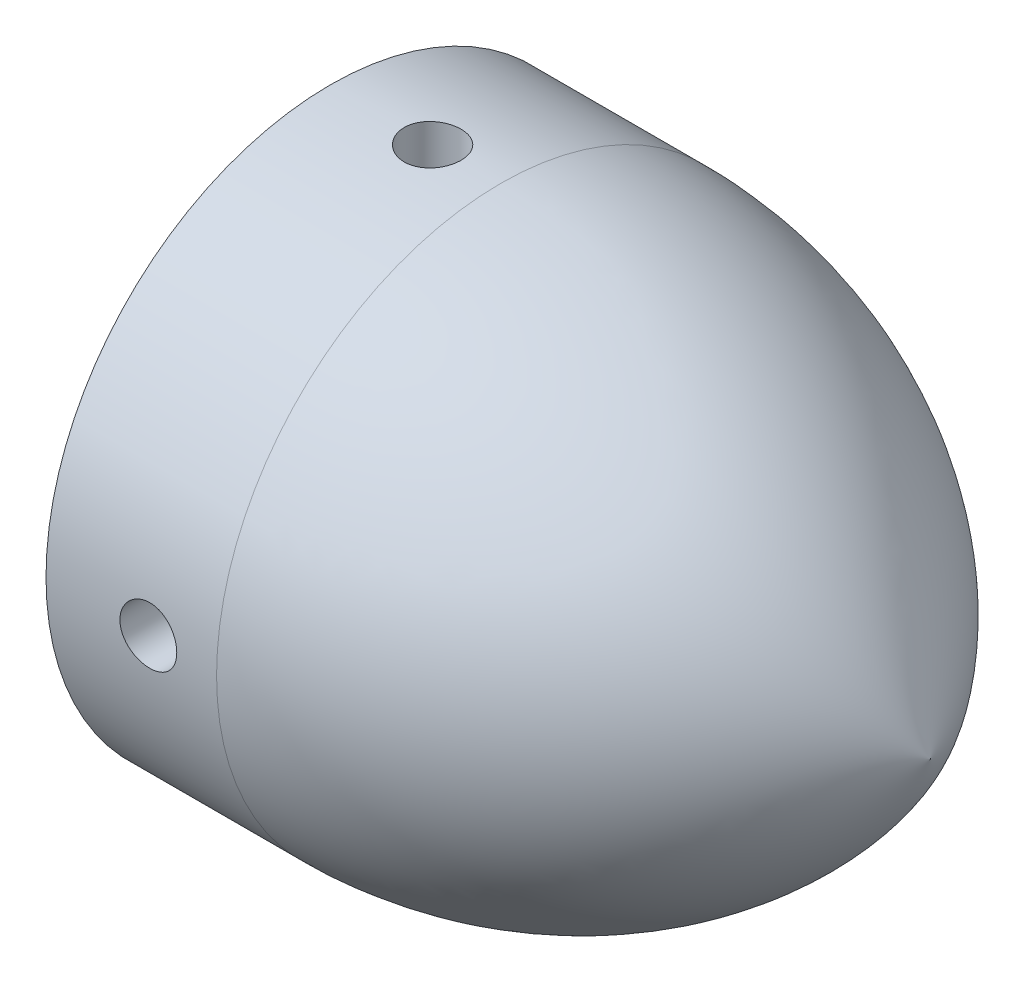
ISO-10303-21;
HEADER;
FILE_DESCRIPTION(('STEP AP214'),'2;1');
FILE_NAME('part.step','',(''),(''),'','','');
FILE_SCHEMA(('AUTOMOTIVE_DESIGN { 1 0 10303 214 1 1 1 1 }'));
ENDSEC;
DATA;
#1=APPLICATION_CONTEXT('core data for automotive mechanical design processes');
#2=APPLICATION_PROTOCOL_DEFINITION('international standard','automotive_design',2000,#1);
#3=PRODUCT_CONTEXT('',#1,'mechanical');
#4=PRODUCT('Part','Part','',(#3));
#5=PRODUCT_RELATED_PRODUCT_CATEGORY('part','',(#4));
#6=PRODUCT_DEFINITION_FORMATION('','',#4);
#7=PRODUCT_DEFINITION_CONTEXT('part definition',#1,'design');
#8=PRODUCT_DEFINITION('design','',#6,#7);
#9=PRODUCT_DEFINITION_SHAPE('','',#8);
#10=(LENGTH_UNIT() NAMED_UNIT(*) SI_UNIT(.MILLI.,.METRE.));
#11=(NAMED_UNIT(*) PLANE_ANGLE_UNIT() SI_UNIT($,.RADIAN.));
#12=(NAMED_UNIT(*) SI_UNIT($,.STERADIAN.) SOLID_ANGLE_UNIT());
#13=UNCERTAINTY_MEASURE_WITH_UNIT(LENGTH_MEASURE(1.E-05),#10,'distance_accuracy_value','');
#14=(GEOMETRIC_REPRESENTATION_CONTEXT(3) GLOBAL_UNCERTAINTY_ASSIGNED_CONTEXT((#13)) GLOBAL_UNIT_ASSIGNED_CONTEXT((#10,
#11,#12)) REPRESENTATION_CONTEXT('',''));
#15=CARTESIAN_POINT('',(0.,0.,0.));
#16=DIRECTION('',(0.,0.,1.));
#17=DIRECTION('',(1.,0.,0.));
#18=AXIS2_PLACEMENT_3D('',#15,#16,#17);
#19=CARTESIAN_POINT('',(0.,0.,0.));
#20=DIRECTION('',(1.,0.,0.));
#21=DIRECTION('',(0.,0.,-1.));
#22=AXIS2_PLACEMENT_3D('',#19,#20,#21);
#23=PLANE('',#22);
#24=CARTESIAN_POINT('',(0.,0.,0.));
#25=DIRECTION('',(-1.,0.,0.));
#26=DIRECTION('',(0.,0.,1.));
#27=AXIS2_PLACEMENT_3D('',#24,#25,#26);
#28=CIRCLE('',#27,40.);
#29=CARTESIAN_POINT('',(0.,0.,40.));
#30=VERTEX_POINT('',#29);
#31=EDGE_CURVE('E60',#30,#30,#28,.T.);
#32=ORIENTED_EDGE('',*,*,#31,.F.);
#33=EDGE_LOOP('',(#32));
#34=FACE_BOUND('',#33,.T.);
#35=CARTESIAN_POINT('',(0.,0.,0.));
#36=DIRECTION('',(-1.,0.,0.));
#37=DIRECTION('',(0.,0.,1.));
#38=AXIS2_PLACEMENT_3D('',#35,#36,#37);
#39=CIRCLE('',#38,50.);
#40=CARTESIAN_POINT('',(0.,0.,50.));
#41=VERTEX_POINT('',#40);
#42=EDGE_CURVE('E76',#41,#41,#39,.T.);
#43=ORIENTED_EDGE('',*,*,#42,.T.);
#44=EDGE_LOOP('',(#43));
#45=FACE_BOUND('',#44,.T.);
#46=ADVANCED_FACE('F34',(#34,#45),#23,.F.);
#47=CARTESIAN_POINT('',(0.,0.,0.));
#48=DIRECTION('',(-1.,0.,0.));
#49=DIRECTION('',(0.,0.,1.));
#50=AXIS2_PLACEMENT_3D('',#47,#48,#49);
#51=CYLINDRICAL_SURFACE('',#50,50.);
#52=CARTESIAN_POINT('',(18.,-49.7493718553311,-4.99999999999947));
#53=CARTESIAN_POINT('',(17.8599015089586,-49.749371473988,-5.00000137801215));
#54=CARTESIAN_POINT('',(17.7198240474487,-49.7499648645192,-4.99410950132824));
#55=CARTESIAN_POINT('',(17.4406233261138,-49.752320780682,-4.97058574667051));
#56=CARTESIAN_POINT('',(17.3015003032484,-49.7540835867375,-4.9529510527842));
#57=CARTESIAN_POINT('',(17.0251372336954,-49.758730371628,-4.90604778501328));
#58=CARTESIAN_POINT('',(16.8878987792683,-49.761615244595,-4.87676993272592));
#59=CARTESIAN_POINT('',(16.616340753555,-49.7684245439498,-4.80678208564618));
#60=CARTESIAN_POINT('',(16.4820222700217,-49.7723493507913,-4.76606790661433));
#61=CARTESIAN_POINT('',(16.2174387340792,-49.7811214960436,-4.6735529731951));
#62=CARTESIAN_POINT('',(16.0871698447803,-49.7859679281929,-4.62176310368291));
#63=CARTESIAN_POINT('',(15.8314177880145,-49.7964498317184,-4.507424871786));
#64=CARTESIAN_POINT('',(15.7059364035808,-49.8020855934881,-4.44487254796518));
#65=CARTESIAN_POINT('',(15.4607606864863,-49.8139814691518,-4.30950824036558));
#66=CARTESIAN_POINT('',(15.3410630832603,-49.820241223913,-4.2367021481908));
#67=CARTESIAN_POINT('',(15.1081706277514,-49.833213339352,-4.08129001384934));
#68=CARTESIAN_POINT('',(14.9949782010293,-49.8399258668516,-3.99868035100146));
#69=CARTESIAN_POINT('',(14.7756190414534,-49.8536318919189,-3.82401365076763));
#70=CARTESIAN_POINT('',(14.6694733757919,-49.8606261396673,-3.73193021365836));
#71=CARTESIAN_POINT('',(14.4652704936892,-49.8746822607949,-3.53912598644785));
#72=CARTESIAN_POINT('',(14.3672162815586,-49.8817441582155,-3.43840201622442));
#73=CARTESIAN_POINT('',(14.1799593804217,-49.8957312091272,-3.22908697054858));
#74=CARTESIAN_POINT('',(14.0907538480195,-49.9026564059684,-3.12049844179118));
#75=CARTESIAN_POINT('',(13.9217563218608,-49.9161794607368,-2.89614565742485));
#76=CARTESIAN_POINT('',(13.8419678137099,-49.9227771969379,-2.78037876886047));
#77=CARTESIAN_POINT('',(13.6922791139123,-49.9354672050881,-2.54231086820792));
#78=CARTESIAN_POINT('',(13.6223963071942,-49.9415585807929,-2.41999887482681));
#79=CARTESIAN_POINT('',(13.4931611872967,-49.95305247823,-2.16984658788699));
#80=CARTESIAN_POINT('',(13.4338127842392,-49.9584547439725,-2.04200426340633));
#81=CARTESIAN_POINT('',(13.3261283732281,-49.9684119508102,-1.78177823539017));
#82=CARTESIAN_POINT('',(13.2777880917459,-49.9729672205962,-1.64939631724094));
#83=CARTESIAN_POINT('',(13.1924285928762,-49.9811060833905,-1.38098814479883));
#84=CARTESIAN_POINT('',(13.1554135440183,-49.9846893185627,-1.24496056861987));
#85=CARTESIAN_POINT('',(13.0620633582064,-49.9937912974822,-0.833882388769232));
#86=CARTESIAN_POINT('',(13.0229400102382,-49.9977085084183,-0.554665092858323));
#87=CARTESIAN_POINT('',(12.992109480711,-50.0007876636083,0.00624616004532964));
#88=CARTESIAN_POINT('',(13.0004010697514,-49.9999497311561,0.287940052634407));
#89=CARTESIAN_POINT('',(13.0639761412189,-49.9936330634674,0.844932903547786));
#90=CARTESIAN_POINT('',(13.1190915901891,-49.9881709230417,1.12025111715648));
#91=CARTESIAN_POINT('',(13.2745046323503,-49.9732365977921,1.65769893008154));
#92=CARTESIAN_POINT('',(13.3748028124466,-49.9637643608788,1.91982835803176));
#93=CARTESIAN_POINT('',(13.6179140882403,-49.9418468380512,2.42400075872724));
#94=CARTESIAN_POINT('',(13.7608015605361,-49.9293963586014,2.66600763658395));
#95=CARTESIAN_POINT('',(14.0849825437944,-49.9029192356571,3.12266778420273));
#96=CARTESIAN_POINT('',(14.266277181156,-49.8888925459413,3.3373202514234));
#97=CARTESIAN_POINT('',(14.6630711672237,-49.8607646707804,3.73416380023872));
#98=CARTESIAN_POINT('',(14.8787167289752,-49.8466634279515,3.91620871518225));
#99=CARTESIAN_POINT('',(15.3375843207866,-49.8200369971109,4.24153769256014));
#100=CARTESIAN_POINT('',(15.5808063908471,-49.8075118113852,4.38482169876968));
#101=CARTESIAN_POINT('',(16.0880351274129,-49.7854544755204,4.62856091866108));
#102=CARTESIAN_POINT('',(16.3520461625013,-49.7759229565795,4.72900710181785));
#103=CARTESIAN_POINT('',(16.8933030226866,-49.760945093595,4.88410367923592));
#104=CARTESIAN_POINT('',(17.1705484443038,-49.755498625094,4.93875546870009));
#105=CARTESIAN_POINT('',(17.7291208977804,-49.7493290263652,5.00052387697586));
#106=CARTESIAN_POINT('',(18.0104251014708,-49.7485855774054,5.00784498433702));
#107=CARTESIAN_POINT('',(18.5702563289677,-49.7518525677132,4.97528123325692));
#108=CARTESIAN_POINT('',(18.8487833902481,-49.7558629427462,4.9353970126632));
#109=CARTESIAN_POINT('',(19.3945579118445,-49.7681672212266,4.809725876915));
#110=CARTESIAN_POINT('',(19.6618278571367,-49.7764521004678,4.72403565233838));
#111=CARTESIAN_POINT('',(20.1782002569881,-49.7963645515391,4.50928358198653));
#112=CARTESIAN_POINT('',(20.427302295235,-49.8079921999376,4.38022074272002));
#113=CARTESIAN_POINT('',(20.9011998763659,-49.8333292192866,4.08187506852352));
#114=CARTESIAN_POINT('',(21.125909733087,-49.8470455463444,3.91245672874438));
#115=CARTESIAN_POINT('',(21.543775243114,-49.8749916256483,3.53840243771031));
#116=CARTESIAN_POINT('',(21.7369301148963,-49.8892213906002,3.33376561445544));
#117=CARTESIAN_POINT('',(22.0869082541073,-49.9166524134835,2.89419988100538));
#118=CARTESIAN_POINT('',(22.243598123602,-49.9298497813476,2.65916449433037));
#119=CARTESIAN_POINT('',(22.5152790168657,-49.9536720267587,2.16598537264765));
#120=CARTESIAN_POINT('',(22.6302706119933,-49.9642969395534,1.90784195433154));
#121=CARTESIAN_POINT('',(22.8150700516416,-49.9817608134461,1.376292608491));
#122=CARTESIAN_POINT('',(22.8849584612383,-49.9886065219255,1.10291484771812));
#123=CARTESIAN_POINT('',(22.9778108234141,-49.99776363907,0.548079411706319));
#124=CARTESIAN_POINT('',(23.0007760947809,-50.0000751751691,0.266621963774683));
#125=CARTESIAN_POINT('',(22.9995818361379,-49.9999593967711,-0.154560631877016));
#126=CARTESIAN_POINT('',(22.9932830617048,-49.9993276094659,-0.294557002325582));
#127=CARTESIAN_POINT('',(22.9689691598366,-49.9969046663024,-0.573504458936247));
#128=CARTESIAN_POINT('',(22.9509583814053,-49.9951139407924,-0.712455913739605));
#129=CARTESIAN_POINT('',(22.903338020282,-49.9904208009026,-0.988379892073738));
#130=CARTESIAN_POINT('',(22.8737241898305,-49.9875179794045,-1.12535167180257));
#131=CARTESIAN_POINT('',(22.8031292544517,-49.9806844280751,-1.39625643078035));
#132=CARTESIAN_POINT('',(22.7621523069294,-49.9767540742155,-1.53019050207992));
#133=CARTESIAN_POINT('',(22.6691118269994,-49.967974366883,-1.79415256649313));
#134=CARTESIAN_POINT('',(22.6170458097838,-49.963124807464,-1.92417967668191));
#135=CARTESIAN_POINT('',(22.5022278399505,-49.952645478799,-2.17933687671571));
#136=CARTESIAN_POINT('',(22.4394797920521,-49.9470159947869,-2.30446873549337));
#137=CARTESIAN_POINT('',(22.303707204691,-49.9351311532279,-2.54905381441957));
#138=CARTESIAN_POINT('',(22.2306790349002,-49.9288755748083,-2.66850500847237));
#139=CARTESIAN_POINT('',(22.0749077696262,-49.9159178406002,-2.90080624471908));
#140=CARTESIAN_POINT('',(21.9921682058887,-49.9092158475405,-3.01365866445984));
#141=CARTESIAN_POINT('',(21.817134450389,-49.89551955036,-3.23252356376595));
#142=CARTESIAN_POINT('',(21.7247983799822,-49.8885240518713,-3.33850247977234));
#143=CARTESIAN_POINT('',(21.5315725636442,-49.8744696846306,-3.54227369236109));
#144=CARTESIAN_POINT('',(21.4306859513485,-49.8674108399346,-3.64006896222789));
#145=CARTESIAN_POINT('',(21.2209737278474,-49.8534223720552,-3.82688647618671));
#146=CARTESIAN_POINT('',(21.1121433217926,-49.8464928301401,-3.91590334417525));
#147=CARTESIAN_POINT('',(20.8874031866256,-49.8329662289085,-4.08443675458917));
#148=CARTESIAN_POINT('',(20.7714960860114,-49.8263690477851,-4.16395679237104));
#149=CARTESIAN_POINT('',(20.5330311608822,-49.8136731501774,-4.31318841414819));
#150=CARTESIAN_POINT('',(20.410454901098,-49.807575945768,-4.38287067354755));
#151=CARTESIAN_POINT('',(20.1598775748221,-49.7960782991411,-4.5116254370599));
#152=CARTESIAN_POINT('',(20.031878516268,-49.7906776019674,-4.57070182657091));
#153=CARTESIAN_POINT('',(19.7714258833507,-49.7807295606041,-4.67780484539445));
#154=CARTESIAN_POINT('',(19.6389760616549,-49.7761815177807,-4.72584052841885));
#155=CARTESIAN_POINT('',(19.3705126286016,-49.7680650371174,-4.81056224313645));
#156=CARTESIAN_POINT('',(19.2344999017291,-49.76449635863,-4.84725106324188));
#157=CARTESIAN_POINT('',(18.9173342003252,-49.7575042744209,-4.91858203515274));
#158=CARTESIAN_POINT('',(18.7352262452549,-49.7544669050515,-4.94908441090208));
#159=CARTESIAN_POINT('',(18.3687333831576,-49.7504009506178,-4.98979244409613));
#160=CARTESIAN_POINT('',(18.1843484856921,-49.749372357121,-4.99999818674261));
#161=CARTESIAN_POINT('',(18.,-49.7493718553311,-4.99999999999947));
#162=B_SPLINE_CURVE_WITH_KNOTS('',3,(#52,#53,#54,#55,#56,#57,#58,#59,#60,#61,#62,#63,#64,#65,
#66,#67,#68,#69,#70,#71,#72,#73,#74,#75,#76,#77,#78,#79,#80,#81,#82,#83,#84,#85,#86,#87,#88,#89,
#90,#91,#92,#93,#94,#95,#96,#97,#98,#99,#100,#101,#102,#103,#104,#105,#106,#107,#108,#109,#110,
#111,#112,#113,#114,#115,#116,#117,#118,#119,#120,#121,#122,#123,#124,#125,#126,#127,#128,#129,
#130,#131,#132,#133,#134,#135,#136,#137,#138,#139,#140,#141,#142,#143,#144,#145,#146,#147,#148,
#149,#150,#151,#152,#153,#154,#155,#156,#157,#158,#159,#160,#161),.UNSPECIFIED.,.T.,.F.,(4,2,2,
2,2,2,2,2,2,2,2,2,2,2,2,2,2,2,2,2,2,2,2,2,2,2,2,2,2,2,2,2,2,2,2,2,2,2,2,2,2,2,2,2,2,2,2,2,2,2,2,
2,2,2,4),(0.,0.420134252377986,0.840369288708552,1.26093988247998,1.68166455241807,
2.10197763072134,2.52244574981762,2.94267325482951,3.36305644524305,3.78464455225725,
4.20638849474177,4.62799647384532,5.04976002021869,5.47225484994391,5.8949061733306,
6.31739313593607,6.74003541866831,7.58156484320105,8.42307244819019,9.26157288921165,
10.1000842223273,10.9400685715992,11.780077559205,12.6237625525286,13.4674487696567,
14.3113127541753,15.1551510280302,15.9953411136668,16.8355198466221,17.6739320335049,
18.5123634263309,19.3536507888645,20.1949589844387,21.0392981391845,21.8836257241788,
22.7264409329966,23.569232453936,23.9892420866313,24.4090958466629,24.8291034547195,
25.2489575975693,25.6689059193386,26.0887010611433,26.5086448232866,26.9284363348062,
27.3501435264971,27.7716968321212,28.1935067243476,28.6151608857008,29.0380465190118,
29.4607769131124,29.8831594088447,30.3054380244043,30.8582736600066,31.411106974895),.UNSPECIFIED.);
#163=CARTESIAN_POINT('',(18.,-49.7493718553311,-4.99999999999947));
#164=VERTEX_POINT('',#163);
#165=EDGE_CURVE('E11',#164,#164,#162,.T.);
#166=ORIENTED_EDGE('',*,*,#165,.T.);
#167=EDGE_LOOP('',(#166));
#168=FACE_BOUND('',#167,.T.);
#169=CARTESIAN_POINT('',(18.,4.99999999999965,-49.749371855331));
#170=CARTESIAN_POINT('',(17.8599015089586,5.00000137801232,-49.7493714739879));
#171=CARTESIAN_POINT('',(17.7198240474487,4.99410950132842,-49.7499648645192));
#172=CARTESIAN_POINT('',(17.4406233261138,4.97058574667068,-49.752320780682));
#173=CARTESIAN_POINT('',(17.3015003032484,4.95295105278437,-49.7540835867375));
#174=CARTESIAN_POINT('',(17.0251372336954,4.90604778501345,-49.758730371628));
#175=CARTESIAN_POINT('',(16.8878987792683,4.87676993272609,-49.761615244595));
#176=CARTESIAN_POINT('',(16.616340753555,4.80678208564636,-49.7684245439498));
#177=CARTESIAN_POINT('',(16.4820222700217,4.7660679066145,-49.7723493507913));
#178=CARTESIAN_POINT('',(16.2174387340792,4.67355297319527,-49.7811214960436));
#179=CARTESIAN_POINT('',(16.0871698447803,4.62176310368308,-49.7859679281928));
#180=CARTESIAN_POINT('',(15.8314177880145,4.50742487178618,-49.7964498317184));
#181=CARTESIAN_POINT('',(15.7059364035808,4.44487254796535,-49.8020855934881));
#182=CARTESIAN_POINT('',(15.4607606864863,4.30950824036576,-49.8139814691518));
#183=CARTESIAN_POINT('',(15.3410630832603,4.23670214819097,-49.820241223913));
#184=CARTESIAN_POINT('',(15.1081706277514,4.08129001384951,-49.833213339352));
#185=CARTESIAN_POINT('',(14.9949782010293,3.99868035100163,-49.8399258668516));
#186=CARTESIAN_POINT('',(14.7756190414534,3.8240136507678,-49.8536318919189));
#187=CARTESIAN_POINT('',(14.6694733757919,3.73193021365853,-49.8606261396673));
#188=CARTESIAN_POINT('',(14.4652704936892,3.53912598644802,-49.8746822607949));
#189=CARTESIAN_POINT('',(14.3672162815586,3.43840201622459,-49.8817441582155));
#190=CARTESIAN_POINT('',(14.1799593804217,3.22908697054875,-49.8957312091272));
#191=CARTESIAN_POINT('',(14.0907538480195,3.12049844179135,-49.9026564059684));
#192=CARTESIAN_POINT('',(13.9217563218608,2.89614565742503,-49.9161794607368));
#193=CARTESIAN_POINT('',(13.8419678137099,2.78037876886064,-49.9227771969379));
#194=CARTESIAN_POINT('',(13.6922791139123,2.5423108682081,-49.9354672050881));
#195=CARTESIAN_POINT('',(13.6223963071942,2.41999887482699,-49.9415585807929));
#196=CARTESIAN_POINT('',(13.4931611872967,2.16984658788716,-49.95305247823));
#197=CARTESIAN_POINT('',(13.4338127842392,2.0420042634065,-49.9584547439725));
#198=CARTESIAN_POINT('',(13.3261283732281,1.78177823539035,-49.9684119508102));
#199=CARTESIAN_POINT('',(13.2777880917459,1.64939631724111,-49.9729672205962));
#200=CARTESIAN_POINT('',(13.1924285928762,1.380988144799,-49.9811060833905));
#201=CARTESIAN_POINT('',(13.1554135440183,1.24496056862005,-49.9846893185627));
#202=CARTESIAN_POINT('',(13.0620633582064,0.833882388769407,-49.9937912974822));
#203=CARTESIAN_POINT('',(13.0229400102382,0.554665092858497,-49.9977085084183));
#204=CARTESIAN_POINT('',(12.992109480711,-0.0062461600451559,-50.0007876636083));
#205=CARTESIAN_POINT('',(13.0004010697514,-0.287940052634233,-49.9999497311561));
#206=CARTESIAN_POINT('',(13.0639761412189,-0.844932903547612,-49.9936330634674));
#207=CARTESIAN_POINT('',(13.1190915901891,-1.1202511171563,-49.9881709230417));
#208=CARTESIAN_POINT('',(13.2745046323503,-1.65769893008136,-49.9732365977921));
#209=CARTESIAN_POINT('',(13.3748028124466,-1.91982835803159,-49.9637643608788));
#210=CARTESIAN_POINT('',(13.6179140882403,-2.42400075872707,-49.9418468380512));
#211=CARTESIAN_POINT('',(13.7608015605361,-2.66600763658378,-49.9293963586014));
#212=CARTESIAN_POINT('',(14.0849825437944,-3.12266778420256,-49.9029192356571));
#213=CARTESIAN_POINT('',(14.266277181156,-3.33732025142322,-49.8888925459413));
#214=CARTESIAN_POINT('',(14.6630711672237,-3.73416380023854,-49.8607646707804));
#215=CARTESIAN_POINT('',(14.8787167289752,-3.91620871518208,-49.8466634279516));
#216=CARTESIAN_POINT('',(15.3375843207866,-4.24153769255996,-49.8200369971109));
#217=CARTESIAN_POINT('',(15.5808063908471,-4.38482169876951,-49.8075118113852));
#218=CARTESIAN_POINT('',(16.0880351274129,-4.62856091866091,-49.7854544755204));
#219=CARTESIAN_POINT('',(16.3520461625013,-4.72900710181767,-49.7759229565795));
#220=CARTESIAN_POINT('',(16.8933030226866,-4.88410367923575,-49.760945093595));
#221=CARTESIAN_POINT('',(17.1705484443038,-4.93875546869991,-49.755498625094));
#222=CARTESIAN_POINT('',(17.7291208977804,-5.00052387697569,-49.7493290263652));
#223=CARTESIAN_POINT('',(18.0104251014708,-5.00784498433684,-49.7485855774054));
#224=CARTESIAN_POINT('',(18.5702563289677,-4.97528123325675,-49.7518525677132));
#225=CARTESIAN_POINT('',(18.8487833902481,-4.93539701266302,-49.7558629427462));
#226=CARTESIAN_POINT('',(19.3945579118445,-4.80972587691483,-49.7681672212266));
#227=CARTESIAN_POINT('',(19.6618278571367,-4.72403565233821,-49.7764521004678));
#228=CARTESIAN_POINT('',(20.1782002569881,-4.50928358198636,-49.7963645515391));
#229=CARTESIAN_POINT('',(20.427302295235,-4.38022074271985,-49.8079921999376));
#230=CARTESIAN_POINT('',(20.9011998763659,-4.08187506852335,-49.8333292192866));
#231=CARTESIAN_POINT('',(21.125909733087,-3.91245672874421,-49.8470455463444));
#232=CARTESIAN_POINT('',(21.543775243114,-3.53840243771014,-49.8749916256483));
#233=CARTESIAN_POINT('',(21.7369301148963,-3.33376561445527,-49.8892213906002));
#234=CARTESIAN_POINT('',(22.0869082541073,-2.8941998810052,-49.9166524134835));
#235=CARTESIAN_POINT('',(22.243598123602,-2.65916449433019,-49.9298497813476));
#236=CARTESIAN_POINT('',(22.5152790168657,-2.16598537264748,-49.9536720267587));
#237=CARTESIAN_POINT('',(22.6302706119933,-1.90784195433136,-49.9642969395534));
#238=CARTESIAN_POINT('',(22.8150700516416,-1.37629260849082,-49.9817608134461));
#239=CARTESIAN_POINT('',(22.8849584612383,-1.10291484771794,-49.9886065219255));
#240=CARTESIAN_POINT('',(22.9778108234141,-0.548079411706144,-49.99776363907));
#241=CARTESIAN_POINT('',(23.0007760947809,-0.266621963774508,-50.0000751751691));
#242=CARTESIAN_POINT('',(22.9995818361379,0.154560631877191,-49.9999593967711));
#243=CARTESIAN_POINT('',(22.9932830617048,0.294557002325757,-49.9993276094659));
#244=CARTESIAN_POINT('',(22.9689691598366,0.573504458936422,-49.9969046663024));
#245=CARTESIAN_POINT('',(22.9509583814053,0.712455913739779,-49.9951139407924));
#246=CARTESIAN_POINT('',(22.903338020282,0.988379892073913,-49.9904208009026));
#247=CARTESIAN_POINT('',(22.8737241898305,1.12535167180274,-49.9875179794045));
#248=CARTESIAN_POINT('',(22.8031292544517,1.39625643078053,-49.9806844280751));
#249=CARTESIAN_POINT('',(22.7621523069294,1.53019050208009,-49.9767540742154));
#250=CARTESIAN_POINT('',(22.6691118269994,1.7941525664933,-49.967974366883));
#251=CARTESIAN_POINT('',(22.6170458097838,1.92417967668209,-49.963124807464));
#252=CARTESIAN_POINT('',(22.5022278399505,2.17933687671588,-49.952645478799));
#253=CARTESIAN_POINT('',(22.4394797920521,2.30446873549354,-49.9470159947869));
#254=CARTESIAN_POINT('',(22.303707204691,2.54905381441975,-49.9351311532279));
#255=CARTESIAN_POINT('',(22.2306790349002,2.66850500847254,-49.9288755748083));
#256=CARTESIAN_POINT('',(22.0749077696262,2.90080624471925,-49.9159178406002));
#257=CARTESIAN_POINT('',(21.9921682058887,3.01365866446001,-49.9092158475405));
#258=CARTESIAN_POINT('',(21.817134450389,3.23252356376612,-49.89551955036));
#259=CARTESIAN_POINT('',(21.7247983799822,3.33850247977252,-49.8885240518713));
#260=CARTESIAN_POINT('',(21.5315725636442,3.54227369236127,-49.8744696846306));
#261=CARTESIAN_POINT('',(21.4306859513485,3.64006896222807,-49.8674108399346));
#262=CARTESIAN_POINT('',(21.2209737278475,3.82688647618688,-49.8534223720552));
#263=CARTESIAN_POINT('',(21.1121433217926,3.91590334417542,-49.8464928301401));
#264=CARTESIAN_POINT('',(20.8874031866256,4.08443675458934,-49.8329662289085));
#265=CARTESIAN_POINT('',(20.7714960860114,4.16395679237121,-49.8263690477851));
#266=CARTESIAN_POINT('',(20.5330311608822,4.31318841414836,-49.8136731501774));
#267=CARTESIAN_POINT('',(20.410454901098,4.38287067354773,-49.807575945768));
#268=CARTESIAN_POINT('',(20.159877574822,4.51162543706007,-49.7960782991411));
#269=CARTESIAN_POINT('',(20.031878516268,4.57070182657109,-49.7906776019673));
#270=CARTESIAN_POINT('',(19.7714258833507,4.67780484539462,-49.7807295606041));
#271=CARTESIAN_POINT('',(19.6389760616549,4.72584052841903,-49.7761815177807));
#272=CARTESIAN_POINT('',(19.3705126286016,4.81056224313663,-49.7680650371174));
#273=CARTESIAN_POINT('',(19.2344999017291,4.84725106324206,-49.76449635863));
#274=CARTESIAN_POINT('',(18.9173342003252,4.91858203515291,-49.7575042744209));
#275=CARTESIAN_POINT('',(18.7352262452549,4.94908441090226,-49.7544669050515));
#276=CARTESIAN_POINT('',(18.3687333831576,4.9897924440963,-49.7504009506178));
#277=CARTESIAN_POINT('',(18.1843484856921,4.99999818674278,-49.749372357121));
#278=CARTESIAN_POINT('',(18.,4.99999999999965,-49.749371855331));
#279=B_SPLINE_CURVE_WITH_KNOTS('',3,(#169,#170,#171,#172,#173,#174,#175,#176,#177,#178,#179,
#180,#181,#182,#183,#184,#185,#186,#187,#188,#189,#190,#191,#192,#193,#194,#195,#196,#197,#198,
#199,#200,#201,#202,#203,#204,#205,#206,#207,#208,#209,#210,#211,#212,#213,#214,#215,#216,#217,
#218,#219,#220,#221,#222,#223,#224,#225,#226,#227,#228,#229,#230,#231,#232,#233,#234,#235,#236,
#237,#238,#239,#240,#241,#242,#243,#244,#245,#246,#247,#248,#249,#250,#251,#252,#253,#254,#255,
#256,#257,#258,#259,#260,#261,#262,#263,#264,#265,#266,#267,#268,#269,#270,#271,#272,#273,#274,
#275,#276,#277,#278),.UNSPECIFIED.,.T.,.F.,(4,2,2,2,2,2,2,2,2,2,2,2,2,2,2,2,2,2,2,2,2,2,2,2,2,2,
2,2,2,2,2,2,2,2,2,2,2,2,2,2,2,2,2,2,2,2,2,2,2,2,2,2,2,2,4),(0.,0.420134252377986,
0.840369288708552,1.26093988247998,1.68166455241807,2.10197763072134,2.52244574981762,
2.9426732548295,3.36305644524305,3.78464455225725,4.20638849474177,4.62799647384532,
5.04976002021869,5.47225484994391,5.8949061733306,6.31739313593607,6.74003541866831,
7.58156484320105,8.42307244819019,9.26157288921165,10.1000842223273,10.9400685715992,
11.780077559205,12.6237625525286,13.4674487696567,14.3113127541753,15.1551510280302,
15.9953411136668,16.8355198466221,17.6739320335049,18.5123634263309,19.3536507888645,
20.1949589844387,21.0392981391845,21.8836257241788,22.7264409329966,23.569232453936,
23.9892420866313,24.4090958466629,24.8291034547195,25.2489575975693,25.6689059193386,
26.0887010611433,26.5086448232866,26.9284363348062,27.3501435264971,27.7716968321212,
28.1935067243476,28.6151608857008,29.0380465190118,29.4607769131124,29.8831594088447,
30.3054380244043,30.8582736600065,31.411106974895),.UNSPECIFIED.);
#280=CARTESIAN_POINT('',(18.,4.99999999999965,-49.749371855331));
#281=VERTEX_POINT('',#280);
#282=EDGE_CURVE('E44',#281,#281,#279,.T.);
#283=ORIENTED_EDGE('',*,*,#282,.T.);
#284=EDGE_LOOP('',(#283));
#285=FACE_BOUND('',#284,.T.);
#286=CARTESIAN_POINT('',(18.,49.749371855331,4.99999999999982));
#287=CARTESIAN_POINT('',(17.8599015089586,49.7493714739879,5.0000013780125));
#288=CARTESIAN_POINT('',(17.7198240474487,49.7499648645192,4.99410950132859));
#289=CARTESIAN_POINT('',(17.4406233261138,49.752320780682,4.97058574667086));
#290=CARTESIAN_POINT('',(17.3015003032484,49.7540835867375,4.95295105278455));
#291=CARTESIAN_POINT('',(17.0251372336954,49.758730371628,4.90604778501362));
#292=CARTESIAN_POINT('',(16.8878987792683,49.7616152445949,4.87676993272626));
#293=CARTESIAN_POINT('',(16.616340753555,49.7684245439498,4.80678208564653));
#294=CARTESIAN_POINT('',(16.4820222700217,49.7723493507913,4.76606790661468));
#295=CARTESIAN_POINT('',(16.2174387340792,49.7811214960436,4.67355297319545));
#296=CARTESIAN_POINT('',(16.0871698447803,49.7859679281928,4.62176310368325));
#297=CARTESIAN_POINT('',(15.8314177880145,49.7964498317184,4.50742487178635));
#298=CARTESIAN_POINT('',(15.7059364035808,49.8020855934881,4.44487254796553));
#299=CARTESIAN_POINT('',(15.4607606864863,49.8139814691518,4.30950824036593));
#300=CARTESIAN_POINT('',(15.3410630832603,49.820241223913,4.23670214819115));
#301=CARTESIAN_POINT('',(15.1081706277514,49.833213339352,4.08129001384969));
#302=CARTESIAN_POINT('',(14.9949782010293,49.8399258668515,3.99868035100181));
#303=CARTESIAN_POINT('',(14.7756190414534,49.8536318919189,3.82401365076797));
#304=CARTESIAN_POINT('',(14.6694733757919,49.8606261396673,3.7319302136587));
#305=CARTESIAN_POINT('',(14.4652704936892,49.8746822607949,3.53912598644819));
#306=CARTESIAN_POINT('',(14.3672162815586,49.8817441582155,3.43840201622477));
#307=CARTESIAN_POINT('',(14.1799593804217,49.8957312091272,3.22908697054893));
#308=CARTESIAN_POINT('',(14.0907538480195,49.9026564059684,3.12049844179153));
#309=CARTESIAN_POINT('',(13.9217563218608,49.9161794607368,2.8961456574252));
#310=CARTESIAN_POINT('',(13.8419678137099,49.9227771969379,2.78037876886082));
#311=CARTESIAN_POINT('',(13.6922791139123,49.9354672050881,2.54231086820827));
#312=CARTESIAN_POINT('',(13.6223963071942,49.9415585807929,2.41999887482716));
#313=CARTESIAN_POINT('',(13.4931611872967,49.95305247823,2.16984658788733));
#314=CARTESIAN_POINT('',(13.4338127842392,49.9584547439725,2.04200426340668));
#315=CARTESIAN_POINT('',(13.3261283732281,49.9684119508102,1.78177823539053));
#316=CARTESIAN_POINT('',(13.2777880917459,49.9729672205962,1.64939631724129));
#317=CARTESIAN_POINT('',(13.1924285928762,49.9811060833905,1.38098814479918));
#318=CARTESIAN_POINT('',(13.1554135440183,49.9846893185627,1.24496056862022));
#319=CARTESIAN_POINT('',(13.0620633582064,49.9937912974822,0.833882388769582));
#320=CARTESIAN_POINT('',(13.0229400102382,49.9977085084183,0.554665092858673));
#321=CARTESIAN_POINT('',(12.992109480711,50.0007876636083,-0.00624616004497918));
#322=CARTESIAN_POINT('',(13.0004010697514,49.9999497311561,-0.287940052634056));
#323=CARTESIAN_POINT('',(13.0639761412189,49.9936330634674,-0.844932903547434));
#324=CARTESIAN_POINT('',(13.1190915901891,49.9881709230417,-1.12025111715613));
#325=CARTESIAN_POINT('',(13.2745046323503,49.9732365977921,-1.65769893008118));
#326=CARTESIAN_POINT('',(13.3748028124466,49.9637643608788,-1.91982835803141));
#327=CARTESIAN_POINT('',(13.6179140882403,49.9418468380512,-2.42400075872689));
#328=CARTESIAN_POINT('',(13.7608015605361,49.9293963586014,-2.6660076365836));
#329=CARTESIAN_POINT('',(14.0849825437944,49.9029192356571,-3.12266778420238));
#330=CARTESIAN_POINT('',(14.266277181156,49.8888925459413,-3.33732025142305));
#331=CARTESIAN_POINT('',(14.6630711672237,49.8607646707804,-3.73416380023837));
#332=CARTESIAN_POINT('',(14.8787167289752,49.8466634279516,-3.9162087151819));
#333=CARTESIAN_POINT('',(15.3375843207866,49.8200369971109,-4.24153769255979));
#334=CARTESIAN_POINT('',(15.5808063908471,49.8075118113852,-4.38482169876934));
#335=CARTESIAN_POINT('',(16.0880351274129,49.7854544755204,-4.62856091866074));
#336=CARTESIAN_POINT('',(16.3520461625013,49.7759229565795,-4.7290071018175));
#337=CARTESIAN_POINT('',(16.8933030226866,49.760945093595,-4.88410367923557));
#338=CARTESIAN_POINT('',(17.1705484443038,49.755498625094,-4.93875546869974));
#339=CARTESIAN_POINT('',(17.7291208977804,49.7493290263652,-5.00052387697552));
#340=CARTESIAN_POINT('',(18.0104251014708,49.7485855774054,-5.00784498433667));
#341=CARTESIAN_POINT('',(18.5702563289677,49.7518525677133,-4.97528123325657));
#342=CARTESIAN_POINT('',(18.8487833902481,49.7558629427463,-4.93539701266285));
#343=CARTESIAN_POINT('',(19.3945579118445,49.7681672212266,-4.80972587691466));
#344=CARTESIAN_POINT('',(19.6618278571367,49.7764521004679,-4.72403565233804));
#345=CARTESIAN_POINT('',(20.1782002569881,49.7963645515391,-4.50928358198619));
#346=CARTESIAN_POINT('',(20.427302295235,49.8079921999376,-4.38022074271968));
#347=CARTESIAN_POINT('',(20.9011998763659,49.8333292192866,-4.08187506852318));
#348=CARTESIAN_POINT('',(21.125909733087,49.8470455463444,-3.91245672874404));
#349=CARTESIAN_POINT('',(21.543775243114,49.8749916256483,-3.53840243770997));
#350=CARTESIAN_POINT('',(21.7369301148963,49.8892213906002,-3.3337656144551));
#351=CARTESIAN_POINT('',(22.0869082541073,49.9166524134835,-2.89419988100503));
#352=CARTESIAN_POINT('',(22.243598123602,49.9298497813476,-2.65916449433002));
#353=CARTESIAN_POINT('',(22.5152790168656,49.9536720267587,-2.16598537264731));
#354=CARTESIAN_POINT('',(22.6302706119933,49.9642969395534,-1.90784195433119));
#355=CARTESIAN_POINT('',(22.8150700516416,49.9817608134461,-1.37629260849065));
#356=CARTESIAN_POINT('',(22.8849584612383,49.9886065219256,-1.10291484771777));
#357=CARTESIAN_POINT('',(22.9778108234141,49.99776363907,-0.548079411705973));
#358=CARTESIAN_POINT('',(23.0007760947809,50.0000751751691,-0.266621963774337));
#359=CARTESIAN_POINT('',(22.9995818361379,49.9999593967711,0.154560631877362));
#360=CARTESIAN_POINT('',(22.9932830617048,49.9993276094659,0.294557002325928));
#361=CARTESIAN_POINT('',(22.9689691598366,49.9969046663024,0.573504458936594));
#362=CARTESIAN_POINT('',(22.9509583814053,49.9951139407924,0.712455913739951));
#363=CARTESIAN_POINT('',(22.903338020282,49.9904208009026,0.988379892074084));
#364=CARTESIAN_POINT('',(22.8737241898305,49.9875179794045,1.12535167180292));
#365=CARTESIAN_POINT('',(22.8031292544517,49.9806844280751,1.3962564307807));
#366=CARTESIAN_POINT('',(22.7621523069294,49.9767540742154,1.53019050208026));
#367=CARTESIAN_POINT('',(22.6691118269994,49.967974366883,1.79415256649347));
#368=CARTESIAN_POINT('',(22.6170458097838,49.963124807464,1.92417967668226));
#369=CARTESIAN_POINT('',(22.5022278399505,49.952645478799,2.17933687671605));
#370=CARTESIAN_POINT('',(22.4394797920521,49.9470159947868,2.30446873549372));
#371=CARTESIAN_POINT('',(22.303707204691,49.9351311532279,2.54905381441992));
#372=CARTESIAN_POINT('',(22.2306790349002,49.9288755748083,2.66850500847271));
#373=CARTESIAN_POINT('',(22.0749077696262,49.9159178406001,2.90080624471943));
#374=CARTESIAN_POINT('',(21.9921682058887,49.9092158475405,3.01365866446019));
#375=CARTESIAN_POINT('',(21.817134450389,49.89551955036,3.2325235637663));
#376=CARTESIAN_POINT('',(21.7247983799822,49.8885240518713,3.33850247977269));
#377=CARTESIAN_POINT('',(21.5315725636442,49.8744696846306,3.54227369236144));
#378=CARTESIAN_POINT('',(21.4306859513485,49.8674108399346,3.64006896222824));
#379=CARTESIAN_POINT('',(21.2209737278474,49.8534223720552,3.82688647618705));
#380=CARTESIAN_POINT('',(21.1121433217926,49.84649283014,3.9159033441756));
#381=CARTESIAN_POINT('',(20.8874031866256,49.8329662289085,4.08443675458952));
#382=CARTESIAN_POINT('',(20.7714960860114,49.8263690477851,4.16395679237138));
#383=CARTESIAN_POINT('',(20.5330311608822,49.8136731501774,4.31318841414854));
#384=CARTESIAN_POINT('',(20.410454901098,49.807575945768,4.3828706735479));
#385=CARTESIAN_POINT('',(20.159877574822,49.7960782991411,4.51162543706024));
#386=CARTESIAN_POINT('',(20.031878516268,49.7906776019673,4.57070182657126));
#387=CARTESIAN_POINT('',(19.7714258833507,49.7807295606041,4.6778048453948));
#388=CARTESIAN_POINT('',(19.6389760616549,49.7761815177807,4.7258405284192));
#389=CARTESIAN_POINT('',(19.3705126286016,49.7680650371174,4.8105622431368));
#390=CARTESIAN_POINT('',(19.2344999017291,49.7644963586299,4.84725106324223));
#391=CARTESIAN_POINT('',(18.9173342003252,49.7575042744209,4.91858203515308));
#392=CARTESIAN_POINT('',(18.7352262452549,49.7544669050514,4.94908441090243));
#393=CARTESIAN_POINT('',(18.3687333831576,49.7504009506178,4.98979244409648));
#394=CARTESIAN_POINT('',(18.1843484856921,49.749372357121,4.99999818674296));
#395=CARTESIAN_POINT('',(18.,49.749371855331,4.99999999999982));
#396=B_SPLINE_CURVE_WITH_KNOTS('',3,(#286,#287,#288,#289,#290,#291,#292,#293,#294,#295,#296,
#297,#298,#299,#300,#301,#302,#303,#304,#305,#306,#307,#308,#309,#310,#311,#312,#313,#314,#315,
#316,#317,#318,#319,#320,#321,#322,#323,#324,#325,#326,#327,#328,#329,#330,#331,#332,#333,#334,
#335,#336,#337,#338,#339,#340,#341,#342,#343,#344,#345,#346,#347,#348,#349,#350,#351,#352,#353,
#354,#355,#356,#357,#358,#359,#360,#361,#362,#363,#364,#365,#366,#367,#368,#369,#370,#371,#372,
#373,#374,#375,#376,#377,#378,#379,#380,#381,#382,#383,#384,#385,#386,#387,#388,#389,#390,#391,
#392,#393,#394,#395),.UNSPECIFIED.,.T.,.F.,(4,2,2,2,2,2,2,2,2,2,2,2,2,2,2,2,2,2,2,2,2,2,2,2,2,2,
2,2,2,2,2,2,2,2,2,2,2,2,2,2,2,2,2,2,2,2,2,2,2,2,2,2,2,2,4),(0.,0.420134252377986,
0.840369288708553,1.26093988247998,1.68166455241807,2.10197763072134,2.52244574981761,
2.9426732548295,3.36305644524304,3.78464455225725,4.20638849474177,4.62799647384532,
5.04976002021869,5.47225484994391,5.89490617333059,6.31739313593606,6.74003541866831,
7.58156484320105,8.42307244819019,9.26157288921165,10.1000842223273,10.9400685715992,
11.780077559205,12.6237625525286,13.4674487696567,14.3113127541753,15.1551510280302,
15.9953411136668,16.8355198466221,17.6739320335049,18.5123634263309,19.3536507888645,
20.1949589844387,21.0392981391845,21.8836257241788,22.7264409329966,23.569232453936,
23.9892420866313,24.4090958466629,24.8291034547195,25.2489575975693,25.6689059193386,
26.0887010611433,26.5086448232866,26.9284363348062,27.3501435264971,27.7716968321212,
28.1935067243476,28.6151608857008,29.0380465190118,29.4607769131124,29.8831594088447,
30.3054380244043,30.8582736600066,31.411106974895),.UNSPECIFIED.);
#397=CARTESIAN_POINT('',(18.,49.749371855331,4.99999999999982));
#398=VERTEX_POINT('',#397);
#399=EDGE_CURVE('E85',#398,#398,#396,.T.);
#400=ORIENTED_EDGE('',*,*,#399,.T.);
#401=EDGE_LOOP('',(#400));
#402=FACE_BOUND('',#401,.T.);
#403=CARTESIAN_POINT('',(23.,0.,50.));
#404=CARTESIAN_POINT('',(23.0000013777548,-0.140100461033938,50.0000003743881));
#405=CARTESIAN_POINT('',(22.9941093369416,-0.280179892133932,49.9994099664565));
#406=CARTESIAN_POINT('',(22.9705849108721,-0.559384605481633,49.9970656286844));
#407=CARTESIAN_POINT('',(22.9529497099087,-0.698509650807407,49.9953114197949));
#408=CARTESIAN_POINT('',(22.9060450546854,-0.974876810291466,49.990686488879));
#409=CARTESIAN_POINT('',(22.8767663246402,-1.11211733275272,49.9878148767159));
#410=CARTESIAN_POINT('',(22.806776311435,-1.38367953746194,49.9810352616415));
#411=CARTESIAN_POINT('',(22.7660608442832,-1.51800013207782,49.9771268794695));
#412=CARTESIAN_POINT('',(22.673542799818,-1.78258815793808,49.968388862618));
#413=CARTESIAN_POINT('',(22.6217510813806,-1.9128594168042,49.9635601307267));
#414=CARTESIAN_POINT('',(22.5074087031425,-2.16861600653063,49.9531129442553));
#415=CARTESIAN_POINT('',(22.4448540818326,-2.29409955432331,49.9474941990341));
#416=CARTESIAN_POINT('',(22.3094848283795,-2.53927920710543,49.9356297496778));
#417=CARTESIAN_POINT('',(22.2366760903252,-2.65897858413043,49.9293844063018));
#418=CARTESIAN_POINT('',(22.0812584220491,-2.89187409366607,49.9164369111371));
#419=CARTESIAN_POINT('',(21.9986458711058,-3.00506780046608,49.90973459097));
#420=CARTESIAN_POINT('',(21.8239762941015,-3.22442516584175,49.8960438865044));
#421=CARTESIAN_POINT('',(21.7318931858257,-3.33056800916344,49.8890547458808));
#422=CARTESIAN_POINT('',(21.5390902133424,-3.53476522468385,49.8750029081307));
#423=CARTESIAN_POINT('',(21.4383671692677,-3.63281659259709,49.8679401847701));
#424=CARTESIAN_POINT('',(21.22905453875,-3.82006793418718,49.853945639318));
#425=CARTESIAN_POINT('',(21.1204674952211,-3.90927074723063,49.8470137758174));
#426=CARTESIAN_POINT('',(20.8961182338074,-4.07826305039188,49.8334722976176));
#427=CARTESIAN_POINT('',(20.7803533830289,-4.15804905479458,49.8268628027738));
#428=CARTESIAN_POINT('',(20.5422870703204,-4.30773494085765,49.8141453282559));
#429=CARTESIAN_POINT('',(20.4199744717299,-4.37761719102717,49.8080382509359));
#430=CARTESIAN_POINT('',(20.1698210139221,-4.50685113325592,49.796510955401));
#431=CARTESIAN_POINT('',(20.0419781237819,-4.5661989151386,49.7910909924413));
#432=CARTESIAN_POINT('',(19.7817509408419,-4.67388203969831,49.7810984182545));
#433=CARTESIAN_POINT('',(19.6493684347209,-4.72222165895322,49.7765254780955));
#434=CARTESIAN_POINT('',(19.3809589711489,-4.80757979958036,49.7683532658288));
#435=CARTESIAN_POINT('',(19.2449306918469,-4.84459415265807,49.7647543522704));
#436=CARTESIAN_POINT('',(18.8338494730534,-4.93794230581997,49.7556112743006));
#437=CARTESIAN_POINT('',(18.5546295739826,-4.97706409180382,49.7516744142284));
#438=CARTESIAN_POINT('',(17.9937132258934,-5.0078905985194,49.7485802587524));
#439=CARTESIAN_POINT('',(17.7120168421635,-4.9995965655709,49.7494228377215));
#440=CARTESIAN_POINT('',(17.1550347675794,-4.93601762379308,49.7557708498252));
#441=CARTESIAN_POINT('',(16.8797295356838,-4.88090320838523,49.7612593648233));
#442=CARTESIAN_POINT('',(16.3423071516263,-4.72549673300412,49.7762565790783));
#443=CARTESIAN_POINT('',(16.0801901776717,-4.6252040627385,49.7857653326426));
#444=CARTESIAN_POINT('',(15.5760328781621,-4.38210419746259,49.8077505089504));
#445=CARTESIAN_POINT('',(15.3340292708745,-4.23922134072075,49.8202322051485));
#446=CARTESIAN_POINT('',(14.8773737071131,-3.9150502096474,49.846752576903));
#447=CARTESIAN_POINT('',(14.6627225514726,-3.73376081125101,49.8607912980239));
#448=CARTESIAN_POINT('',(14.2658730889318,-3.33697054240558,49.8889192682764));
#449=CARTESIAN_POINT('',(14.0838220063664,-3.12132238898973,49.9030084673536));
#450=CARTESIAN_POINT('',(13.7584818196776,-2.66244741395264,49.9295914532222));
#451=CARTESIAN_POINT('',(13.6151927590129,-2.41922056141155,49.9420852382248));
#452=CARTESIAN_POINT('',(13.3714499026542,-1.911990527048,49.9640737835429));
#453=CARTESIAN_POINT('',(13.2710035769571,-1.64798373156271,49.9735680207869));
#454=CARTESIAN_POINT('',(13.1159054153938,-1.10673608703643,49.988482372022));
#455=CARTESIAN_POINT('',(13.0612522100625,-0.829495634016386,49.9939026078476));
#456=CARTESIAN_POINT('',(12.9994784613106,-0.270925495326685,50.0000425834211));
#457=CARTESIAN_POINT('',(12.992154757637,0.0103815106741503,50.000782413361));
#458=CARTESIAN_POINT('',(13.0247143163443,0.570218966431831,49.9975320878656));
#459=CARTESIAN_POINT('',(13.0645969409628,0.848749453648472,49.993541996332));
#460=CARTESIAN_POINT('',(13.1902684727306,1.39454103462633,49.9812930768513));
#461=CARTESIAN_POINT('',(13.2759622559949,1.66182424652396,49.9730430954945));
#462=CARTESIAN_POINT('',(13.4907258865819,2.17822160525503,49.953199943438));
#463=CARTESIAN_POINT('',(13.6197967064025,2.42733534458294,49.9416066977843));
#464=CARTESIAN_POINT('',(13.9181541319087,2.90124090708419,49.9163237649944));
#465=CARTESIAN_POINT('',(14.0875742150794,3.12594832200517,49.9026271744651));
#466=CARTESIAN_POINT('',(14.4616305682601,3.54380809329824,49.8746966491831));
#467=CARTESIAN_POINT('',(14.666267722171,3.73695965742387,49.8604627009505));
#468=CARTESIAN_POINT('',(15.1058320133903,4.0869306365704,49.8330011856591));
#469=CARTESIAN_POINT('',(15.340865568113,4.24361671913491,49.8197774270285));
#470=CARTESIAN_POINT('',(15.8340400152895,4.51529096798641,49.7958917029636));
#471=CARTESIAN_POINT('',(16.0921805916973,4.63027970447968,49.7852297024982));
#472=CARTESIAN_POINT('',(16.6237317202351,4.81507725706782,49.7676970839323));
#473=CARTESIAN_POINT('',(16.8971145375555,4.88496539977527,49.7608198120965));
#474=CARTESIAN_POINT('',(17.4519606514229,4.97781551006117,49.7516193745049));
#475=CARTESIAN_POINT('',(17.7334237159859,5.0007788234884,49.7492960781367));
#476=CARTESIAN_POINT('',(18.1546072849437,4.99958027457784,49.7494127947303));
#477=CARTESIAN_POINT('',(18.2945992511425,4.99328044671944,49.7500479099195));
#478=CARTESIAN_POINT('',(18.5735377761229,4.96896519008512,49.7524830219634));
#479=CARTESIAN_POINT('',(18.7124847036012,4.95095411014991,49.754282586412));
#480=CARTESIAN_POINT('',(18.9883995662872,4.9033339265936,49.7589979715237));
#481=CARTESIAN_POINT('',(19.1253667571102,4.8737205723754,49.7619142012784));
#482=CARTESIAN_POINT('',(19.3962623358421,4.8031274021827,49.7687776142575));
#483=CARTESIAN_POINT('',(19.530191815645,4.76215174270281,49.7727244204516));
#484=CARTESIAN_POINT('',(19.7941445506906,4.66911475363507,49.7815382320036));
#485=CARTESIAN_POINT('',(19.9241669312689,4.6170509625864,49.7864054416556));
#486=CARTESIAN_POINT('',(20.1793150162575,4.50223825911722,49.7969192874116));
#487=CARTESIAN_POINT('',(20.3044424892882,4.43949325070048,49.8025656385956));
#488=CARTESIAN_POINT('',(20.5490193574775,4.30372744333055,49.8144815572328));
#489=CARTESIAN_POINT('',(20.6684667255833,4.23070301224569,49.82075134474));
#490=CARTESIAN_POINT('',(20.9007610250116,4.07493978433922,49.8337332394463));
#491=CARTESIAN_POINT('',(21.013610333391,3.99220451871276,49.8404451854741));
#492=CARTESIAN_POINT('',(21.2324754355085,3.81717528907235,49.8541564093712));
#493=CARTESIAN_POINT('',(21.3384572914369,3.72483897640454,49.8611568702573));
#494=CARTESIAN_POINT('',(21.5422344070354,3.53161206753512,49.8752152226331));
#495=CARTESIAN_POINT('',(21.640032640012,3.43072460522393,49.8822730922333));
#496=CARTESIAN_POINT('',(21.8268559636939,3.22101009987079,49.8962537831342));
#497=CARTESIAN_POINT('',(21.9158756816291,3.11217826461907,49.9031765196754));
#498=CARTESIAN_POINT('',(22.0844145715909,2.88743471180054,49.9166844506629));
#499=CARTESIAN_POINT('',(22.1639372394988,2.77152562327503,49.9232697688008));
#500=CARTESIAN_POINT('',(22.3131718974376,2.53305926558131,49.9359380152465));
#501=CARTESIAN_POINT('',(22.3828548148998,2.41048371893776,49.9420194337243));
#502=CARTESIAN_POINT('',(22.511610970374,2.15990777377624,49.9534835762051));
#503=CARTESIAN_POINT('',(22.5706880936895,2.03190938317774,49.9588665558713));
#504=CARTESIAN_POINT('',(22.67779263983,1.7714580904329,49.9687792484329));
#505=CARTESIAN_POINT('',(22.7258291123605,1.63900893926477,49.9733096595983));
#506=CARTESIAN_POINT('',(22.8105524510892,1.37054695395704,49.9813929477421));
#507=CARTESIAN_POINT('',(22.8472421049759,1.23453500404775,49.9849460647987));
#508=CARTESIAN_POINT('',(22.9185766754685,0.917364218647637,49.9919068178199));
#509=CARTESIAN_POINT('',(22.9490810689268,0.735250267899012,49.9949297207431));
#510=CARTESIAN_POINT('',(22.9897917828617,0.36874540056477,49.9989760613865));
#511=CARTESIAN_POINT('',(22.9999981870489,0.184354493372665,49.9999995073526));
#512=CARTESIAN_POINT('',(23.,0.,50.));
#513=B_SPLINE_CURVE_WITH_KNOTS('',3,(#403,#404,#405,#406,#407,#408,#409,#410,#411,#412,#413,
#414,#415,#416,#417,#418,#419,#420,#421,#422,#423,#424,#425,#426,#427,#428,#429,#430,#431,#432,
#433,#434,#435,#436,#437,#438,#439,#440,#441,#442,#443,#444,#445,#446,#447,#448,#449,#450,#451,
#452,#453,#454,#455,#456,#457,#458,#459,#460,#461,#462,#463,#464,#465,#466,#467,#468,#469,#470,
#471,#472,#473,#474,#475,#476,#477,#478,#479,#480,#481,#482,#483,#484,#485,#486,#487,#488,#489,
#490,#491,#492,#493,#494,#495,#496,#497,#498,#499,#500,#501,#502,#503,#504,#505,#506,#507,#508,
#509,#510,#511,#512),.UNSPECIFIED.,.T.,.F.,(4,2,2,2,2,2,2,2,2,2,2,2,2,2,2,2,2,2,2,2,2,2,2,2,2,2,
2,2,2,2,2,2,2,2,2,2,2,2,2,2,2,2,2,2,2,2,2,2,2,2,2,2,2,2,4),(0.,0.420140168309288,
0.840381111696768,1.26095751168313,1.68168797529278,2.10200784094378,2.52248274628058,
2.94271694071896,3.36310682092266,3.78468715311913,4.20642331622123,4.62802370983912,
5.04977967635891,5.47227730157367,5.89493142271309,6.31742106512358,6.74006601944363,
7.58160289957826,8.42311766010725,9.26158116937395,10.1000560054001,10.9400293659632,
11.7800273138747,12.6237280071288,13.467429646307,14.3112783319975,15.1551017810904,
15.9953007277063,16.8354883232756,17.6739380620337,18.5124065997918,19.3536883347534,
20.1949911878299,21.0393234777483,21.8836442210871,22.7264758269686,23.5692832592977,
23.9892798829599,24.4091206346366,24.8291153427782,25.2489566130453,25.6688911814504,
26.0886725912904,26.5086027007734,26.9283805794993,27.3500956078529,27.7716567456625,
28.1934743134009,28.6151361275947,29.0380188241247,29.460746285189,29.883126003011,
30.305401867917,30.8582554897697,31.4111068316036),.UNSPECIFIED.);
#514=CARTESIAN_POINT('',(23.,0.,50.));
#515=VERTEX_POINT('',#514);
#516=EDGE_CURVE('E79',#515,#515,#513,.T.);
#517=ORIENTED_EDGE('',*,*,#516,.T.);
#518=EDGE_LOOP('',(#517));
#519=FACE_BOUND('',#518,.T.);
#520=ORIENTED_EDGE('',*,*,#42,.F.);
#521=EDGE_LOOP('',(#520));
#522=FACE_BOUND('',#521,.T.);
#523=CARTESIAN_POINT('',(30.,0.,0.));
#524=DIRECTION('',(-1.,0.,0.));
#525=DIRECTION('',(0.,0.,1.));
#526=AXIS2_PLACEMENT_3D('',#523,#524,#525);
#527=CIRCLE('',#526,50.);
#528=CARTESIAN_POINT('',(30.,0.,50.));
#529=VERTEX_POINT('',#528);
#530=EDGE_CURVE('E72',#529,#529,#527,.T.);
#531=ORIENTED_EDGE('',*,*,#530,.T.);
#532=EDGE_LOOP('',(#531));
#533=FACE_BOUND('',#532,.T.);
#534=ADVANCED_FACE('F89',(#168,#285,#402,#519,#522,#533),#51,.T.);
#535=CARTESIAN_POINT('',(30.,0.,-32.));
#536=DIRECTION('',(0.,-1.,0.));
#537=DIRECTION('',(0.,0.,1.));
#538=AXIS2_PLACEMENT_3D('',#535,#536,#537);
#539=CIRCLE('',#538,82.);
#540=TRIMMED_CURVE('',#539,(PARAMETER_VALUE(-1.16989984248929)),
(PARAMETER_VALUE(1.16989984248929)),.T.,.PARAMETER.);
#541=CARTESIAN_POINT('',(30.,0.,0.));
#542=DIRECTION('',(-1.,0.,0.));
#543=AXIS1_PLACEMENT('',#541,#542);
#544=SURFACE_OF_REVOLUTION('',#540,#543);
#545=ORIENTED_EDGE('',*,*,#530,.F.);
#546=EDGE_LOOP('',(#545));
#547=FACE_BOUND('',#546,.T.);
#548=CARTESIAN_POINT('',(105.498344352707,0.,0.));
#549=VERTEX_POINT('',#548);
#550=VERTEX_LOOP('',#549);
#551=FACE_BOUND('',#550,.T.);
#552=ADVANCED_FACE('F106',(#547,#551),#544,.T.);
#553=CARTESIAN_POINT('',(10.,0.,0.));
#554=DIRECTION('',(-1.,0.,0.));
#555=DIRECTION('',(0.,0.,1.));
#556=AXIS2_PLACEMENT_3D('',#553,#554,#555);
#557=CYLINDRICAL_SURFACE('',#556,40.);
#558=CARTESIAN_POINT('',(10.,0.,0.));
#559=DIRECTION('',(-1.,0.,0.));
#560=DIRECTION('',(0.,0.,1.));
#561=AXIS2_PLACEMENT_3D('',#558,#559,#560);
#562=CIRCLE('',#561,40.);
#563=CARTESIAN_POINT('',(10.,0.,40.));
#564=VERTEX_POINT('',#563);
#565=EDGE_CURVE('E64',#564,#564,#562,.T.);
#566=ORIENTED_EDGE('',*,*,#565,.F.);
#567=EDGE_LOOP('',(#566));
#568=FACE_BOUND('',#567,.T.);
#569=ORIENTED_EDGE('',*,*,#31,.T.);
#570=EDGE_LOOP('',(#569));
#571=FACE_BOUND('',#570,.T.);
#572=ADVANCED_FACE('F103',(#568,#571),#557,.F.);
#573=CARTESIAN_POINT('',(10.,0.,0.));
#574=DIRECTION('',(-1.,0.,0.));
#575=DIRECTION('',(0.,0.,1.));
#576=AXIS2_PLACEMENT_3D('',#573,#574,#575);
#577=PLANE('',#576);
#578=CARTESIAN_POINT('',(10.,0.,0.));
#579=DIRECTION('',(-1.,0.,0.));
#580=DIRECTION('',(0.,0.,1.));
#581=AXIS2_PLACEMENT_3D('',#578,#579,#580);
#582=CIRCLE('',#581,3.4);
#583=CARTESIAN_POINT('',(10.,0.,3.4));
#584=VERTEX_POINT('',#583);
#585=EDGE_CURVE('E61',#584,#584,#582,.T.);
#586=ORIENTED_EDGE('',*,*,#585,.F.);
#587=EDGE_LOOP('',(#586));
#588=FACE_BOUND('',#587,.T.);
#589=ORIENTED_EDGE('',*,*,#565,.T.);
#590=EDGE_LOOP('',(#589));
#591=FACE_BOUND('',#590,.T.);
#592=ADVANCED_FACE('F54',(#588,#591),#577,.T.);
#593=CARTESIAN_POINT('',(30.,0.,0.));
#594=DIRECTION('',(-1.,0.,0.));
#595=DIRECTION('',(0.,0.,1.));
#596=AXIS2_PLACEMENT_3D('',#593,#594,#595);
#597=CONICAL_SURFACE('',#596,3.39999999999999,1.02974425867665);
#598=CARTESIAN_POINT('',(32.0429261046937,0.,0.));
#599=VERTEX_POINT('',#598);
#600=VERTEX_LOOP('',#599);
#601=FACE_BOUND('',#600,.T.);
#602=CARTESIAN_POINT('',(30.,0.,0.));
#603=DIRECTION('',(-1.,0.,0.));
#604=DIRECTION('',(0.,0.,1.));
#605=AXIS2_PLACEMENT_3D('',#602,#603,#604);
#606=CIRCLE('',#605,3.39999999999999);
#607=CARTESIAN_POINT('',(30.,0.,3.39999999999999));
#608=VERTEX_POINT('',#607);
#609=EDGE_CURVE('E58',#608,#608,#606,.T.);
#610=ORIENTED_EDGE('',*,*,#609,.T.);
#611=EDGE_LOOP('',(#610));
#612=FACE_BOUND('',#611,.T.);
#613=ADVANCED_FACE('F50',(#601,#612),#597,.F.);
#614=CARTESIAN_POINT('',(10.,0.,0.));
#615=DIRECTION('',(-1.,0.,0.));
#616=DIRECTION('',(0.,0.,1.));
#617=AXIS2_PLACEMENT_3D('',#614,#615,#616);
#618=CYLINDRICAL_SURFACE('',#617,3.4);
#619=ORIENTED_EDGE('',*,*,#609,.F.);
#620=EDGE_LOOP('',(#619));
#621=FACE_BOUND('',#620,.T.);
#622=ORIENTED_EDGE('',*,*,#585,.T.);
#623=EDGE_LOOP('',(#622));
#624=FACE_BOUND('',#623,.T.);
#625=ADVANCED_FACE('F53',(#621,#624),#618,.F.);
#626=CARTESIAN_POINT('',(18.,0.,30.));
#627=DIRECTION('',(0.,0.,1.));
#628=DIRECTION('',(1.,0.,0.));
#629=AXIS2_PLACEMENT_3D('',#626,#627,#628);
#630=CYLINDRICAL_SURFACE('',#629,5.);
#631=CARTESIAN_POINT('',(18.,0.,30.));
#632=DIRECTION('',(0.,0.,1.));
#633=DIRECTION('',(1.,0.,0.));
#634=AXIS2_PLACEMENT_3D('',#631,#632,#633);
#635=CIRCLE('',#634,5.);
#636=CARTESIAN_POINT('',(23.,0.,30.));
#637=VERTEX_POINT('',#636);
#638=EDGE_CURVE('E67',#637,#637,#635,.T.);
#639=ORIENTED_EDGE('',*,*,#638,.F.);
#640=EDGE_LOOP('',(#639));
#641=FACE_BOUND('',#640,.T.);
#642=ORIENTED_EDGE('',*,*,#516,.F.);
#643=EDGE_LOOP('',(#642));
#644=FACE_BOUND('',#643,.T.);
#645=ADVANCED_FACE('F92',(#641,#644),#630,.F.);
#646=CARTESIAN_POINT('',(18.,0.,30.));
#647=DIRECTION('',(0.,0.,1.));
#648=DIRECTION('',(1.,0.,0.));
#649=AXIS2_PLACEMENT_3D('',#646,#647,#648);
#650=PLANE('',#649);
#651=ORIENTED_EDGE('',*,*,#638,.T.);
#652=EDGE_LOOP('',(#651));
#653=FACE_BOUND('',#652,.T.);
#654=ADVANCED_FACE('F97',(#653),#650,.T.);
#655=CARTESIAN_POINT('',(18.,30.,-1.11683394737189E-13));
#656=DIRECTION('',(0.,1.,0.));
#657=DIRECTION('',(0.,0.,1.));
#658=AXIS2_PLACEMENT_3D('',#655,#656,#657);
#659=CYLINDRICAL_SURFACE('',#658,5.);
#660=CARTESIAN_POINT('',(18.,30.,-1.11683394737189E-13));
#661=DIRECTION('',(0.,1.,0.));
#662=DIRECTION('',(1.,0.,0.));
#663=AXIS2_PLACEMENT_3D('',#660,#661,#662);
#664=CIRCLE('',#663,5.);
#665=CARTESIAN_POINT('',(23.,30.,-1.11683394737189E-13));
#666=VERTEX_POINT('',#665);
#667=EDGE_CURVE('E220',#666,#666,#664,.T.);
#668=ORIENTED_EDGE('',*,*,#667,.F.);
#669=EDGE_LOOP('',(#668));
#670=FACE_BOUND('',#669,.T.);
#671=ORIENTED_EDGE('',*,*,#399,.F.);
#672=EDGE_LOOP('',(#671));
#673=FACE_BOUND('',#672,.T.);
#674=ADVANCED_FACE('F141',(#670,#673),#659,.F.);
#675=CARTESIAN_POINT('',(18.,30.,-1.11683394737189E-13));
#676=DIRECTION('',(0.,1.,0.));
#677=DIRECTION('',(1.,0.,0.));
#678=AXIS2_PLACEMENT_3D('',#675,#676,#677);
#679=PLANE('',#678);
#680=ORIENTED_EDGE('',*,*,#667,.T.);
#681=EDGE_LOOP('',(#680));
#682=FACE_BOUND('',#681,.T.);
#683=ADVANCED_FACE('F146',(#682),#679,.T.);
#684=CARTESIAN_POINT('',(18.,-2.1642789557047E-13,-30.));
#685=DIRECTION('',(0.,0.,-1.));
#686=DIRECTION('',(0.,1.,0.));
#687=AXIS2_PLACEMENT_3D('',#684,#685,#686);
#688=CYLINDRICAL_SURFACE('',#687,5.);
#689=CARTESIAN_POINT('',(18.,-2.1642789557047E-13,-30.));
#690=DIRECTION('',(0.,0.,-1.));
#691=DIRECTION('',(1.,0.,0.));
#692=AXIS2_PLACEMENT_3D('',#689,#690,#691);
#693=CIRCLE('',#692,5.);
#694=CARTESIAN_POINT('',(23.,-2.1642789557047E-13,-30.));
#695=VERTEX_POINT('',#694);
#696=EDGE_CURVE('E217',#695,#695,#693,.T.);
#697=ORIENTED_EDGE('',*,*,#696,.F.);
#698=EDGE_LOOP('',(#697));
#699=FACE_BOUND('',#698,.T.);
#700=ORIENTED_EDGE('',*,*,#282,.F.);
#701=EDGE_LOOP('',(#700));
#702=FACE_BOUND('',#701,.T.);
#703=ADVANCED_FACE('F155',(#699,#702),#688,.F.);
#704=CARTESIAN_POINT('',(18.,-2.1642789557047E-13,-30.));
#705=DIRECTION('',(0.,0.,-1.));
#706=DIRECTION('',(1.,0.,0.));
#707=AXIS2_PLACEMENT_3D('',#704,#705,#706);
#708=PLANE('',#707);
#709=ORIENTED_EDGE('',*,*,#696,.T.);
#710=EDGE_LOOP('',(#709));
#711=FACE_BOUND('',#710,.T.);
#712=ADVANCED_FACE('F165',(#711),#708,.T.);
#713=CARTESIAN_POINT('',(18.,-30.,3.21172396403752E-13));
#714=DIRECTION('',(0.,-1.,0.));
#715=DIRECTION('',(0.,0.,-1.));
#716=AXIS2_PLACEMENT_3D('',#713,#714,#715);
#717=CYLINDRICAL_SURFACE('',#716,5.);
#718=CARTESIAN_POINT('',(18.,-30.,3.21172396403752E-13));
#719=DIRECTION('',(0.,-1.,0.));
#720=DIRECTION('',(1.,0.,0.));
#721=AXIS2_PLACEMENT_3D('',#718,#719,#720);
#722=CIRCLE('',#721,5.);
#723=CARTESIAN_POINT('',(23.,-30.,3.21172396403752E-13));
#724=VERTEX_POINT('',#723);
#725=EDGE_CURVE('E216',#724,#724,#722,.T.);
#726=ORIENTED_EDGE('',*,*,#725,.F.);
#727=EDGE_LOOP('',(#726));
#728=FACE_BOUND('',#727,.T.);
#729=ORIENTED_EDGE('',*,*,#165,.F.);
#730=EDGE_LOOP('',(#729));
#731=FACE_BOUND('',#730,.T.);
#732=ADVANCED_FACE('F175',(#728,#731),#717,.F.);
#733=CARTESIAN_POINT('',(18.,-30.,3.21172396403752E-13));
#734=DIRECTION('',(0.,-1.,0.));
#735=DIRECTION('',(1.,0.,0.));
#736=AXIS2_PLACEMENT_3D('',#733,#734,#735);
#737=PLANE('',#736);
#738=ORIENTED_EDGE('',*,*,#725,.T.);
#739=EDGE_LOOP('',(#738));
#740=FACE_BOUND('',#739,.T.);
#741=ADVANCED_FACE('F185',(#740),#737,.T.);
#742=CLOSED_SHELL('',(#46,#534,#552,#572,#592,#613,#625,#645,#654,#674,#683,#703,#712,#732,#741));
#743=MANIFOLD_SOLID_BREP('B2',#742);
#744=ADVANCED_BREP_SHAPE_REPRESENTATION('',(#18,#743),#14);
#745=SHAPE_DEFINITION_REPRESENTATION(#9,#744);
ENDSEC;
END-ISO-10303-21;
